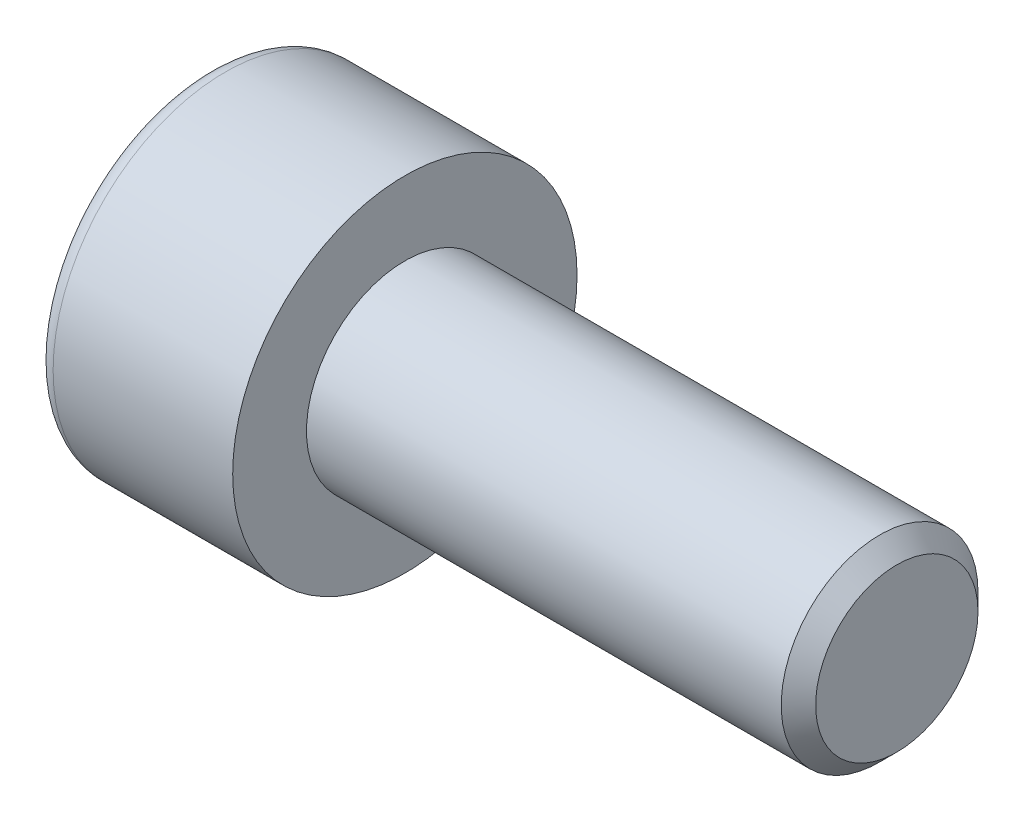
ISO-10303-21;
HEADER;
FILE_DESCRIPTION(('STEP AP214'),'2;1');
FILE_NAME('part.step','',(''),(''),'','','');
FILE_SCHEMA(('AUTOMOTIVE_DESIGN { 1 0 10303 214 1 1 1 1 }'));
ENDSEC;
DATA;
#1=APPLICATION_CONTEXT('core data for automotive mechanical design processes');
#2=APPLICATION_PROTOCOL_DEFINITION('international standard','automotive_design',2000,#1);
#3=PRODUCT_CONTEXT('',#1,'mechanical');
#4=PRODUCT('Part','Part','',(#3));
#5=PRODUCT_RELATED_PRODUCT_CATEGORY('part','',(#4));
#6=PRODUCT_DEFINITION_FORMATION('','',#4);
#7=PRODUCT_DEFINITION_CONTEXT('part definition',#1,'design');
#8=PRODUCT_DEFINITION('design','',#6,#7);
#9=PRODUCT_DEFINITION_SHAPE('','',#8);
#10=(LENGTH_UNIT() NAMED_UNIT(*) SI_UNIT(.MILLI.,.METRE.));
#11=(NAMED_UNIT(*) PLANE_ANGLE_UNIT() SI_UNIT($,.RADIAN.));
#12=(NAMED_UNIT(*) SI_UNIT($,.STERADIAN.) SOLID_ANGLE_UNIT());
#13=UNCERTAINTY_MEASURE_WITH_UNIT(LENGTH_MEASURE(1.E-05),#10,'distance_accuracy_value','');
#14=(GEOMETRIC_REPRESENTATION_CONTEXT(3) GLOBAL_UNCERTAINTY_ASSIGNED_CONTEXT((#13)) GLOBAL_UNIT_ASSIGNED_CONTEXT((#10,
#11,#12)) REPRESENTATION_CONTEXT('',''));
#15=CARTESIAN_POINT('',(0.,0.,0.));
#16=DIRECTION('',(0.,0.,1.));
#17=DIRECTION('',(1.,0.,0.));
#18=AXIS2_PLACEMENT_3D('',#15,#16,#17);
#19=CARTESIAN_POINT('',(12.5013072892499,0.,0.));
#20=DIRECTION('',(1.,0.,0.));
#21=DIRECTION('',(0.,0.,-1.));
#22=AXIS2_PLACEMENT_3D('',#19,#20,#21);
#23=CYLINDRICAL_SURFACE('',#22,2.);
#24=CARTESIAN_POINT('',(9.65,0.,0.));
#25=DIRECTION('',(1.,0.,0.));
#26=DIRECTION('',(0.,0.,-1.));
#27=AXIS2_PLACEMENT_3D('',#24,#25,#26);
#28=CIRCLE('',#27,2.);
#29=CARTESIAN_POINT('',(9.65,0.,-2.));
#30=VERTEX_POINT('',#29);
#31=EDGE_CURVE('E152',#30,#30,#28,.F.);
#32=ORIENTED_EDGE('',*,*,#31,.T.);
#33=EDGE_LOOP('',(#32));
#34=FACE_BOUND('',#33,.T.);
#35=CARTESIAN_POINT('',(0.,0.,0.));
#36=DIRECTION('',(1.,0.,0.));
#37=DIRECTION('',(0.,0.,-1.));
#38=AXIS2_PLACEMENT_3D('',#35,#36,#37);
#39=CIRCLE('',#38,2.);
#40=CARTESIAN_POINT('',(0.,0.,-2.));
#41=VERTEX_POINT('',#40);
#42=EDGE_CURVE('E138',#41,#41,#39,.T.);
#43=ORIENTED_EDGE('',*,*,#42,.T.);
#44=EDGE_LOOP('',(#43));
#45=FACE_BOUND('',#44,.T.);
#46=ADVANCED_FACE('F36',(#34,#45),#23,.T.);
#47=CARTESIAN_POINT('',(10.,2.,0.));
#48=DIRECTION('',(1.,0.,0.));
#49=DIRECTION('',(0.,0.,-1.));
#50=AXIS2_PLACEMENT_3D('',#47,#48,#49);
#51=PLANE('',#50);
#52=CARTESIAN_POINT('',(10.,0.,0.));
#53=DIRECTION('',(1.,0.,0.));
#54=DIRECTION('',(0.,0.,-1.));
#55=AXIS2_PLACEMENT_3D('',#52,#53,#54);
#56=CIRCLE('',#55,1.65);
#57=CARTESIAN_POINT('',(10.,0.,-1.65));
#58=VERTEX_POINT('',#57);
#59=EDGE_CURVE('E149',#58,#58,#56,.T.);
#60=ORIENTED_EDGE('',*,*,#59,.T.);
#61=EDGE_LOOP('',(#60));
#62=FACE_BOUND('',#61,.T.);
#63=ADVANCED_FACE('F174',(#62),#51,.T.);
#64=CARTESIAN_POINT('',(-4.,3.5,0.));
#65=DIRECTION('',(-1.,0.,0.));
#66=DIRECTION('',(0.,0.,1.));
#67=AXIS2_PLACEMENT_3D('',#64,#65,#66);
#68=PLANE('',#67);
#69=DIRECTION('',(0.,0.866025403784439,0.5));
#70=VECTOR('',#69,1.);
#71=CARTESIAN_POINT('',(-4.,-1.5,0.866025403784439));
#72=LINE('',#71,#70);
#73=CARTESIAN_POINT('',(-4.,-1.5,0.866025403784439));
#74=VERTEX_POINT('',#73);
#75=CARTESIAN_POINT('',(-4.,0.,1.73205080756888));
#76=VERTEX_POINT('',#75);
#77=EDGE_CURVE('E51',#74,#76,#72,.T.);
#78=ORIENTED_EDGE('',*,*,#77,.F.);
#79=DIRECTION('',(0.,0.,1.));
#80=VECTOR('',#79,1.);
#81=CARTESIAN_POINT('',(-4.,-1.5,-0.866025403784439));
#82=LINE('',#81,#80);
#83=CARTESIAN_POINT('',(-4.,-1.5,-0.866025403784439));
#84=VERTEX_POINT('',#83);
#85=EDGE_CURVE('E134',#84,#74,#82,.T.);
#86=ORIENTED_EDGE('',*,*,#85,.F.);
#87=DIRECTION('',(0.,-0.866025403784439,0.5));
#88=VECTOR('',#87,1.);
#89=CARTESIAN_POINT('',(-4.,0.,-1.73205080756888));
#90=LINE('',#89,#88);
#91=CARTESIAN_POINT('',(-4.,0.,-1.73205080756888));
#92=VERTEX_POINT('',#91);
#93=EDGE_CURVE('E132',#92,#84,#90,.T.);
#94=ORIENTED_EDGE('',*,*,#93,.F.);
#95=DIRECTION('',(0.,-0.866025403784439,-0.5));
#96=VECTOR('',#95,1.);
#97=CARTESIAN_POINT('',(-4.,1.5,-0.866025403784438));
#98=LINE('',#97,#96);
#99=CARTESIAN_POINT('',(-4.,1.5,-0.866025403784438));
#100=VERTEX_POINT('',#99);
#101=EDGE_CURVE('E99',#100,#92,#98,.T.);
#102=ORIENTED_EDGE('',*,*,#101,.F.);
#103=DIRECTION('',(0.,0.,-1.));
#104=VECTOR('',#103,1.);
#105=CARTESIAN_POINT('',(-4.,1.5,0.866025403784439));
#106=LINE('',#105,#104);
#107=CARTESIAN_POINT('',(-4.,1.5,0.866025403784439));
#108=VERTEX_POINT('',#107);
#109=EDGE_CURVE('E128',#108,#100,#106,.T.);
#110=ORIENTED_EDGE('',*,*,#109,.F.);
#111=DIRECTION('',(0.,0.866025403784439,-0.5));
#112=VECTOR('',#111,1.);
#113=CARTESIAN_POINT('',(-4.,0.,1.73205080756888));
#114=LINE('',#113,#112);
#115=EDGE_CURVE('E125',#76,#108,#114,.T.);
#116=ORIENTED_EDGE('',*,*,#115,.F.);
#117=EDGE_LOOP('',(#78,#86,#94,#102,#110,#116));
#118=FACE_BOUND('',#117,.T.);
#119=CARTESIAN_POINT('',(-4.,0.,0.));
#120=DIRECTION('',(-1.,0.,0.));
#121=DIRECTION('',(0.,0.,1.));
#122=AXIS2_PLACEMENT_3D('',#119,#120,#121);
#123=CIRCLE('',#122,3.15);
#124=CARTESIAN_POINT('',(-4.,0.,3.15));
#125=VERTEX_POINT('',#124);
#126=EDGE_CURVE('E11',#125,#125,#123,.T.);
#127=ORIENTED_EDGE('',*,*,#126,.T.);
#128=EDGE_LOOP('',(#127));
#129=FACE_BOUND('',#128,.T.);
#130=ADVANCED_FACE('F180',(#118,#129),#68,.T.);
#131=CARTESIAN_POINT('',(12.5013072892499,0.,0.));
#132=DIRECTION('',(1.,0.,0.));
#133=DIRECTION('',(0.,0.,-1.));
#134=AXIS2_PLACEMENT_3D('',#131,#132,#133);
#135=CYLINDRICAL_SURFACE('',#134,3.5);
#136=CARTESIAN_POINT('',(-3.65,0.,0.));
#137=DIRECTION('',(-1.,0.,0.));
#138=DIRECTION('',(0.,0.,1.));
#139=AXIS2_PLACEMENT_3D('',#136,#137,#138);
#140=CIRCLE('',#139,3.5);
#141=CARTESIAN_POINT('',(-3.65,0.,3.5));
#142=VERTEX_POINT('',#141);
#143=EDGE_CURVE('E44',#142,#142,#140,.F.);
#144=ORIENTED_EDGE('',*,*,#143,.T.);
#145=EDGE_LOOP('',(#144));
#146=FACE_BOUND('',#145,.T.);
#147=CARTESIAN_POINT('',(0.,0.,0.));
#148=DIRECTION('',(1.,0.,0.));
#149=DIRECTION('',(0.,0.,-1.));
#150=AXIS2_PLACEMENT_3D('',#147,#148,#149);
#151=CIRCLE('',#150,3.5);
#152=CARTESIAN_POINT('',(0.,0.,-3.5));
#153=VERTEX_POINT('',#152);
#154=EDGE_CURVE('E146',#153,#153,#151,.T.);
#155=ORIENTED_EDGE('',*,*,#154,.F.);
#156=EDGE_LOOP('',(#155));
#157=FACE_BOUND('',#156,.T.);
#158=ADVANCED_FACE('F157',(#146,#157),#135,.T.);
#159=CARTESIAN_POINT('',(0.,2.,0.));
#160=DIRECTION('',(1.,0.,0.));
#161=DIRECTION('',(0.,0.,-1.));
#162=AXIS2_PLACEMENT_3D('',#159,#160,#161);
#163=PLANE('',#162);
#164=ORIENTED_EDGE('',*,*,#154,.T.);
#165=EDGE_LOOP('',(#164));
#166=FACE_BOUND('',#165,.T.);
#167=ORIENTED_EDGE('',*,*,#42,.F.);
#168=EDGE_LOOP('',(#167));
#169=FACE_BOUND('',#168,.T.);
#170=ADVANCED_FACE('F170',(#166,#169),#163,.T.);
#171=CARTESIAN_POINT('',(10.,0.,0.));
#172=DIRECTION('',(-1.,0.,0.));
#173=DIRECTION('',(0.,0.,1.));
#174=AXIS2_PLACEMENT_3D('',#171,#172,#173);
#175=CONICAL_SURFACE('',#174,1.65,0.785398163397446);
#176=ORIENTED_EDGE('',*,*,#31,.F.);
#177=EDGE_LOOP('',(#176));
#178=FACE_BOUND('',#177,.T.);
#179=ORIENTED_EDGE('',*,*,#59,.F.);
#180=EDGE_LOOP('',(#179));
#181=FACE_BOUND('',#180,.T.);
#182=ADVANCED_FACE('F162',(#178,#181),#175,.T.);
#183=CARTESIAN_POINT('',(-3.65,0.,0.));
#184=DIRECTION('',(-1.,0.,0.));
#185=DIRECTION('',(0.,0.,1.));
#186=AXIS2_PLACEMENT_3D('',#183,#184,#185);
#187=TOROIDAL_SURFACE('',#186,3.15,0.35);
#188=ORIENTED_EDGE('',*,*,#126,.F.);
#189=EDGE_LOOP('',(#188));
#190=FACE_BOUND('',#189,.T.);
#191=ORIENTED_EDGE('',*,*,#143,.F.);
#192=EDGE_LOOP('',(#191));
#193=FACE_BOUND('',#192,.T.);
#194=ADVANCED_FACE('F38',(#190,#193),#187,.T.);
#195=CARTESIAN_POINT('',(-1.6,-1.5,0.866025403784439));
#196=DIRECTION('',(0.,-0.5,0.866025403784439));
#197=DIRECTION('',(0.,-0.866025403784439,-0.5));
#198=AXIS2_PLACEMENT_3D('',#195,#196,#197);
#199=PLANE('',#198);
#200=ORIENTED_EDGE('',*,*,#77,.T.);
#201=DIRECTION('',(-1.,0.,0.));
#202=VECTOR('',#201,1.);
#203=CARTESIAN_POINT('',(-1.6,0.,1.73205080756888));
#204=LINE('',#203,#202);
#205=CARTESIAN_POINT('',(-1.6,0.,1.73205080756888));
#206=VERTEX_POINT('',#205);
#207=EDGE_CURVE('E81',#206,#76,#204,.T.);
#208=ORIENTED_EDGE('',*,*,#207,.F.);
#209=DIRECTION('',(0.,0.866025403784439,0.5));
#210=VECTOR('',#209,1.);
#211=CARTESIAN_POINT('',(-1.6,-1.5,0.866025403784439));
#212=LINE('',#211,#210);
#213=CARTESIAN_POINT('',(-1.6,-1.5,0.866025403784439));
#214=VERTEX_POINT('',#213);
#215=EDGE_CURVE('E136',#214,#206,#212,.T.);
#216=ORIENTED_EDGE('',*,*,#215,.F.);
#217=DIRECTION('',(-1.,0.,0.));
#218=VECTOR('',#217,1.);
#219=CARTESIAN_POINT('',(-1.6,-1.5,0.866025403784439));
#220=LINE('',#219,#218);
#221=EDGE_CURVE('E59',#214,#74,#220,.T.);
#222=ORIENTED_EDGE('',*,*,#221,.T.);
#223=EDGE_LOOP('',(#200,#208,#216,#222));
#224=FACE_BOUND('',#223,.T.);
#225=ADVANCED_FACE('F161',(#224),#199,.F.);
#226=CARTESIAN_POINT('',(-1.6,-1.5,-0.866025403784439));
#227=DIRECTION('',(0.,-1.,0.));
#228=DIRECTION('',(0.,0.,-1.));
#229=AXIS2_PLACEMENT_3D('',#226,#227,#228);
#230=PLANE('',#229);
#231=ORIENTED_EDGE('',*,*,#85,.T.);
#232=ORIENTED_EDGE('',*,*,#221,.F.);
#233=DIRECTION('',(0.,0.,1.));
#234=VECTOR('',#233,1.);
#235=CARTESIAN_POINT('',(-1.6,-1.5,-0.866025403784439));
#236=LINE('',#235,#234);
#237=CARTESIAN_POINT('',(-1.6,-1.5,-0.866025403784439));
#238=VERTEX_POINT('',#237);
#239=EDGE_CURVE('E111',#238,#214,#236,.T.);
#240=ORIENTED_EDGE('',*,*,#239,.F.);
#241=DIRECTION('',(-1.,0.,0.));
#242=VECTOR('',#241,1.);
#243=CARTESIAN_POINT('',(-1.6,-1.5,-0.866025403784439));
#244=LINE('',#243,#242);
#245=EDGE_CURVE('E103',#238,#84,#244,.T.);
#246=ORIENTED_EDGE('',*,*,#245,.T.);
#247=EDGE_LOOP('',(#231,#232,#240,#246));
#248=FACE_BOUND('',#247,.T.);
#249=ADVANCED_FACE('F168',(#248),#230,.F.);
#250=CARTESIAN_POINT('',(-1.6,0.,-1.73205080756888));
#251=DIRECTION('',(0.,-0.5,-0.866025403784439));
#252=DIRECTION('',(0.,0.866025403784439,-0.5));
#253=AXIS2_PLACEMENT_3D('',#250,#251,#252);
#254=PLANE('',#253);
#255=ORIENTED_EDGE('',*,*,#93,.T.);
#256=ORIENTED_EDGE('',*,*,#245,.F.);
#257=DIRECTION('',(0.,-0.866025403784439,0.5));
#258=VECTOR('',#257,1.);
#259=CARTESIAN_POINT('',(-1.6,0.,-1.73205080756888));
#260=LINE('',#259,#258);
#261=CARTESIAN_POINT('',(-1.6,0.,-1.73205080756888));
#262=VERTEX_POINT('',#261);
#263=EDGE_CURVE('E107',#262,#238,#260,.T.);
#264=ORIENTED_EDGE('',*,*,#263,.F.);
#265=DIRECTION('',(-1.,0.,0.));
#266=VECTOR('',#265,1.);
#267=CARTESIAN_POINT('',(-1.6,0.,-1.73205080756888));
#268=LINE('',#267,#266);
#269=EDGE_CURVE('E92',#262,#92,#268,.T.);
#270=ORIENTED_EDGE('',*,*,#269,.T.);
#271=EDGE_LOOP('',(#255,#256,#264,#270));
#272=FACE_BOUND('',#271,.T.);
#273=ADVANCED_FACE('F108',(#272),#254,.F.);
#274=CARTESIAN_POINT('',(-1.6,1.5,-0.866025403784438));
#275=DIRECTION('',(0.,0.5,-0.866025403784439));
#276=DIRECTION('',(0.,0.866025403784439,0.5));
#277=AXIS2_PLACEMENT_3D('',#274,#275,#276);
#278=PLANE('',#277);
#279=ORIENTED_EDGE('',*,*,#101,.T.);
#280=ORIENTED_EDGE('',*,*,#269,.F.);
#281=DIRECTION('',(0.,-0.866025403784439,-0.5));
#282=VECTOR('',#281,1.);
#283=CARTESIAN_POINT('',(-1.6,1.5,-0.866025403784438));
#284=LINE('',#283,#282);
#285=CARTESIAN_POINT('',(-1.6,1.5,-0.866025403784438));
#286=VERTEX_POINT('',#285);
#287=EDGE_CURVE('E96',#286,#262,#284,.T.);
#288=ORIENTED_EDGE('',*,*,#287,.F.);
#289=DIRECTION('',(-1.,0.,0.));
#290=VECTOR('',#289,1.);
#291=CARTESIAN_POINT('',(-1.6,1.5,-0.866025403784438));
#292=LINE('',#291,#290);
#293=EDGE_CURVE('E104',#286,#100,#292,.T.);
#294=ORIENTED_EDGE('',*,*,#293,.T.);
#295=EDGE_LOOP('',(#279,#280,#288,#294));
#296=FACE_BOUND('',#295,.T.);
#297=ADVANCED_FACE('F94',(#296),#278,.F.);
#298=CARTESIAN_POINT('',(-1.6,1.5,0.866025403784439));
#299=DIRECTION('',(0.,1.,0.));
#300=DIRECTION('',(0.,0.,1.));
#301=AXIS2_PLACEMENT_3D('',#298,#299,#300);
#302=PLANE('',#301);
#303=ORIENTED_EDGE('',*,*,#109,.T.);
#304=ORIENTED_EDGE('',*,*,#293,.F.);
#305=DIRECTION('',(0.,0.,-1.));
#306=VECTOR('',#305,1.);
#307=CARTESIAN_POINT('',(-1.6,1.5,0.866025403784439));
#308=LINE('',#307,#306);
#309=CARTESIAN_POINT('',(-1.6,1.5,0.866025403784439));
#310=VERTEX_POINT('',#309);
#311=EDGE_CURVE('E117',#310,#286,#308,.T.);
#312=ORIENTED_EDGE('',*,*,#311,.F.);
#313=DIRECTION('',(-1.,0.,0.));
#314=VECTOR('',#313,1.);
#315=CARTESIAN_POINT('',(-1.6,1.5,0.866025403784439));
#316=LINE('',#315,#314);
#317=EDGE_CURVE('E141',#310,#108,#316,.T.);
#318=ORIENTED_EDGE('',*,*,#317,.T.);
#319=EDGE_LOOP('',(#303,#304,#312,#318));
#320=FACE_BOUND('',#319,.T.);
#321=ADVANCED_FACE('F196',(#320),#302,.F.);
#322=CARTESIAN_POINT('',(-1.6,0.,1.73205080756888));
#323=DIRECTION('',(0.,0.5,0.866025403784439));
#324=DIRECTION('',(0.,-0.866025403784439,0.5));
#325=AXIS2_PLACEMENT_3D('',#322,#323,#324);
#326=PLANE('',#325);
#327=ORIENTED_EDGE('',*,*,#115,.T.);
#328=ORIENTED_EDGE('',*,*,#317,.F.);
#329=DIRECTION('',(0.,0.866025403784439,-0.5));
#330=VECTOR('',#329,1.);
#331=CARTESIAN_POINT('',(-1.6,0.,1.73205080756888));
#332=LINE('',#331,#330);
#333=EDGE_CURVE('E119',#206,#310,#332,.T.);
#334=ORIENTED_EDGE('',*,*,#333,.F.);
#335=ORIENTED_EDGE('',*,*,#207,.T.);
#336=EDGE_LOOP('',(#327,#328,#334,#335));
#337=FACE_BOUND('',#336,.T.);
#338=ADVANCED_FACE('F193',(#337),#326,.F.);
#339=CARTESIAN_POINT('',(-1.6,-1.5,0.866025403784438));
#340=DIRECTION('',(1.,0.,0.));
#341=DIRECTION('',(0.,0.,-1.));
#342=AXIS2_PLACEMENT_3D('',#339,#340,#341);
#343=PLANE('',#342);
#344=ORIENTED_EDGE('',*,*,#215,.T.);
#345=ORIENTED_EDGE('',*,*,#333,.T.);
#346=ORIENTED_EDGE('',*,*,#311,.T.);
#347=ORIENTED_EDGE('',*,*,#287,.T.);
#348=ORIENTED_EDGE('',*,*,#263,.T.);
#349=ORIENTED_EDGE('',*,*,#239,.T.);
#350=EDGE_LOOP('',(#344,#345,#346,#347,#348,#349));
#351=FACE_BOUND('',#350,.T.);
#352=ADVANCED_FACE('F114',(#351),#343,.F.);
#353=CLOSED_SHELL('',(#46,#63,#130,#158,#170,#182,#194,#225,#249,#273,#297,#321,#338,#352));
#354=MANIFOLD_SOLID_BREP('B2',#353);
#355=ADVANCED_BREP_SHAPE_REPRESENTATION('',(#18,#354),#14);
#356=SHAPE_DEFINITION_REPRESENTATION(#9,#355);
ENDSEC;
END-ISO-10303-21;
